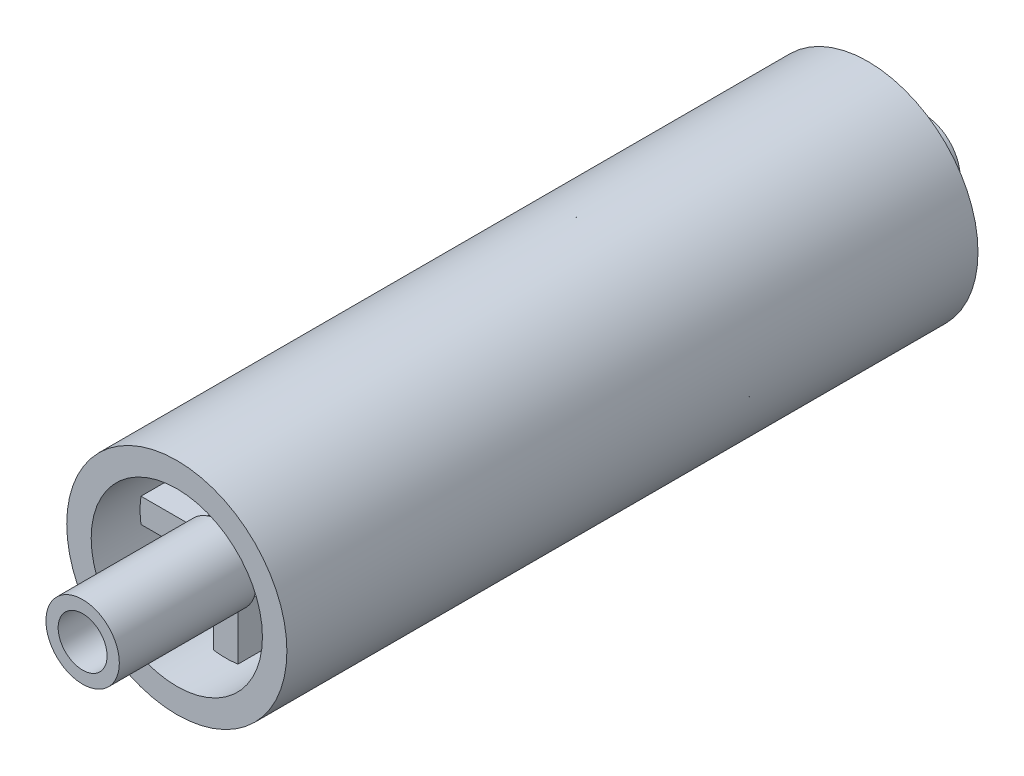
from build123d import *
from build123d.topology import SkipClean

# Parameters (mm, degrees)
ESQUISSE1_R                  = 9
ESQUISSE1_R_2                = 7
EXTRUSION1_DEPTH             = 34.25
EXTRUSION2_DEPTH             = 24.25
ENL_V_MAT_EXTRU_1_DEPTH      = 37.538507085
ENL_V_MAT_EXTRU_1_DEPTH_BACK = 37.538507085
ESQUISSE3_R                  = 3
ESQUISSE4_R                  = 3
ESQUISSE4_R_2                = 2
EXTRUSION3_DEPTH             = 9.5
ESQUISSE5_R                  = 3
EXTRUSION4_DEPTH             = 8.55
ESQUISSE6_OUTSIDE_W          = 34.616
ESQUISSE6_OUTSIDE_H          = 34.616
ESQUISSE6_OUTSIDE_R          = 3
ENL_V_MAT_EXTRU_2_DEPTH      = 6
ESQUISSE7_OUTSIDE_W          = 34.616
ESQUISSE7_OUTSIDE_H          = 34.616
ESQUISSE7_OUTSIDE_R          = 3
ENL_V_MAT_EXTRU_4_DEPTH      = 6
ESQUISSE8_R                  = 3
ENL_V_MAT_EXTRU_5_DEPTH      = 1.45
ESQUISSE9_R                  = 3
ESQUISSE9_R_2                = 2
EXTRUSION5_DEPTH             = 1.7


with BuildPart() as part:
    # Esquisse1 → Extrusion1 (new, symmetric)
    with BuildSketch(Plane.XY):
        Circle(ESQUISSE1_R)
        Circle(ESQUISSE1_R_2, mode=Mode.SUBTRACT)
    extrude(amount=EXTRUSION1_DEPTH, both=True)

    # Esquisse2 → Extrusion2 (add, symmetric)
    with BuildSketch(Plane.XY):
        Polygon((-8.123909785, 1), (-1, 1), (-1, 7.538190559), (1, 7.538190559), (1, 1), (7.653703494, 1), (7.653703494, -1), (1, -1), (1, -8.077877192), (-1, -8.077877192), (-1, -1), (-8.123909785, -1), align=None)
    extrude(amount=EXTRUSION2_DEPTH, both=True)

    # Esquisse3 → Enl_v. mat.-Extru.1 (cut, two sides: drawn at the far end of the back side and taken through both)
    with BuildSketch(Plane.XY.offset(-ENL_V_MAT_EXTRU_1_DEPTH_BACK)):
        Circle(ESQUISSE3_R)
    extrude(amount=ENL_V_MAT_EXTRU_1_DEPTH + ENL_V_MAT_EXTRU_1_DEPTH_BACK, mode=Mode.SUBTRACT)

    # Esquisse6 outside → Enl_v. mat.-Extru.2 (cut)
    with BuildSketch(Plane(origin=(0, 0, -34.25), x_dir=(-1, 0, 0), z_dir=(0, 0, -1))):
        Rectangle(ESQUISSE6_OUTSIDE_W, ESQUISSE6_OUTSIDE_H)
        Circle(ESQUISSE6_OUTSIDE_R, mode=Mode.SUBTRACT)
    extrude(amount=-ENL_V_MAT_EXTRU_2_DEPTH, mode=Mode.SUBTRACT)

    # Esquisse7 outside → Enl_v. mat.-Extru.4 (cut)
    with BuildSketch(Plane.XY.offset(34.25)):
        Rectangle(ESQUISSE7_OUTSIDE_W, ESQUISSE7_OUTSIDE_H)
        with Locations(Location((0, 0, 0), (0, 0, 180))):
            Circle(ESQUISSE7_OUTSIDE_R, mode=Mode.SUBTRACT)
    extrude(amount=-ENL_V_MAT_EXTRU_4_DEPTH, mode=Mode.SUBTRACT)


with BuildPart() as body_2:
    # Esquisse4 → Extrusion3 (new body)
    with BuildSketch(Plane.XY.offset(34.25)):
        Circle(ESQUISSE4_R)
        Circle(ESQUISSE4_R_2, mode=Mode.SUBTRACT)
    extrude(amount=-EXTRUSION3_DEPTH)

    # Esquisse9 → Extrusion5 (add)
    with SkipClean():  # the faces are left unmerged after this step: merging them gives an invalid solid
        with BuildSketch(Plane.XY.offset(34.25)):
            with Locations(Location((0, 0, 0), (0, 0, 180))):
                Circle(ESQUISSE9_R)
            Circle(ESQUISSE9_R_2, mode=Mode.SUBTRACT)
        extrude(amount=EXTRUSION5_DEPTH)


with BuildPart() as body_3:
    # Esquisse5 → Extrusion4 (new body)
    with BuildSketch(Plane(origin=(0, 0, -34.25), x_dir=(-1, 0, 0), z_dir=(0, 0, -1))):
        Circle(ESQUISSE5_R)
        with BuildLine():
            Line((-1.322875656, 1.5), (1.322875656, 1.5))
            ThreePointArc((1.322875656, 1.5), (2, 0), (1.322875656, -1.5))
            Line((1.322875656, -1.5), (-1.322875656, -1.5))
            ThreePointArc((-1.322875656, -1.5), (-2, 0), (-1.322875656, 1.5))
        make_face(mode=Mode.SUBTRACT)
    extrude(amount=-EXTRUSION4_DEPTH)

    # Esquisse8 → Enl_v. mat.-Extru.5 (cut)
    with BuildSketch(Plane(origin=(0, 0, -34.25), x_dir=(-1, 0, 0), z_dir=(0, 0, -1))):
        Circle(ESQUISSE8_R)
    extrude(amount=-ENL_V_MAT_EXTRU_5_DEPTH, mode=Mode.SUBTRACT)


solid = Compound([part.part, body_2.part, body_3.part])
